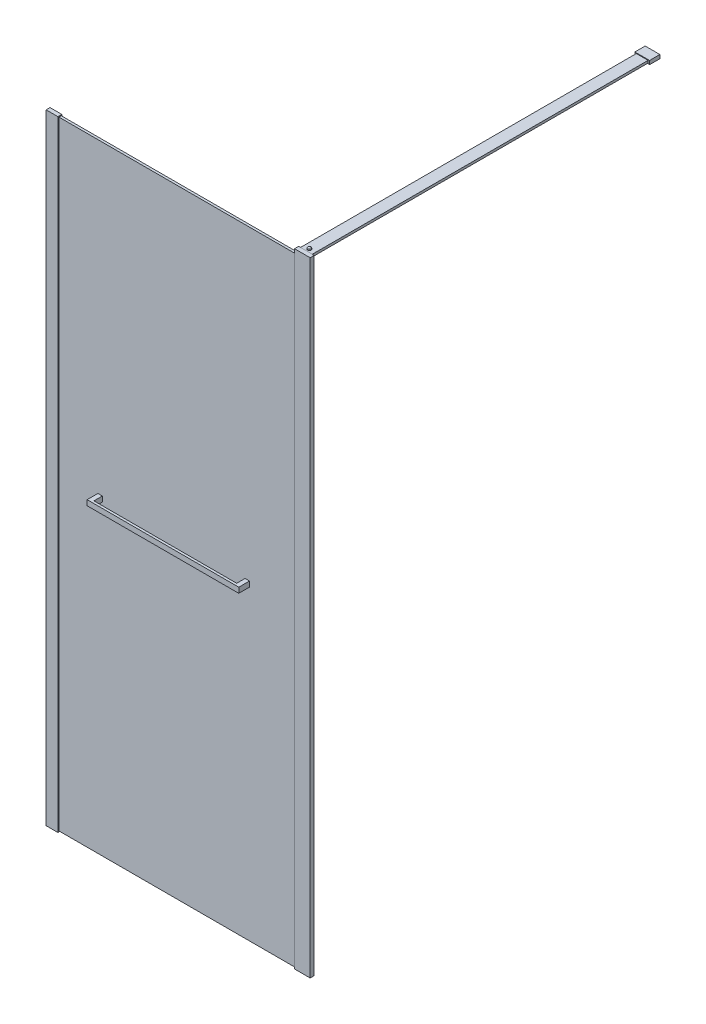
ISO-10303-21;
HEADER;
FILE_DESCRIPTION(('STEP AP214'),'2;1');
FILE_NAME('part.step','',(''),(''),'','','');
FILE_SCHEMA(('AUTOMOTIVE_DESIGN { 1 0 10303 214 1 1 1 1 }'));
ENDSEC;
DATA;
#1=APPLICATION_CONTEXT('core data for automotive mechanical design processes');
#2=APPLICATION_PROTOCOL_DEFINITION('international standard','automotive_design',2000,#1);
#3=PRODUCT_CONTEXT('',#1,'mechanical');
#4=PRODUCT('Part','Part','',(#3));
#5=PRODUCT_RELATED_PRODUCT_CATEGORY('part','',(#4));
#6=PRODUCT_DEFINITION_FORMATION('','',#4);
#7=PRODUCT_DEFINITION_CONTEXT('part definition',#1,'design');
#8=PRODUCT_DEFINITION('design','',#6,#7);
#9=PRODUCT_DEFINITION_SHAPE('','',#8);
#10=(LENGTH_UNIT() NAMED_UNIT(*) SI_UNIT(.MILLI.,.METRE.));
#11=(NAMED_UNIT(*) PLANE_ANGLE_UNIT() SI_UNIT($,.RADIAN.));
#12=(NAMED_UNIT(*) SI_UNIT($,.STERADIAN.) SOLID_ANGLE_UNIT());
#13=UNCERTAINTY_MEASURE_WITH_UNIT(LENGTH_MEASURE(1.E-05),#10,'distance_accuracy_value','');
#14=(GEOMETRIC_REPRESENTATION_CONTEXT(3) GLOBAL_UNCERTAINTY_ASSIGNED_CONTEXT((#13)) GLOBAL_UNIT_ASSIGNED_CONTEXT((#10,
#11,#12)) REPRESENTATION_CONTEXT('',''));
#15=CARTESIAN_POINT('',(0.,0.,0.));
#16=DIRECTION('',(0.,0.,1.));
#17=DIRECTION('',(1.,0.,0.));
#18=AXIS2_PLACEMENT_3D('',#15,#16,#17);
#19=CARTESIAN_POINT('',(187.5,1062.,-21.4));
#20=DIRECTION('',(1.,0.,0.));
#21=DIRECTION('',(0.,0.,-1.));
#22=AXIS2_PLACEMENT_3D('',#19,#20,#21);
#23=PLANE('',#22);
#24=DIRECTION('',(0.,1.,0.));
#25=VECTOR('',#24,1.);
#26=CARTESIAN_POINT('',(187.5,1062.,25.1));
#27=LINE('',#26,#25);
#28=CARTESIAN_POINT('',(187.5,1044.,25.1));
#29=VERTEX_POINT('',#28);
#30=CARTESIAN_POINT('',(187.5,1062.,25.1));
#31=VERTEX_POINT('',#30);
#32=EDGE_CURVE('E63',#29,#31,#27,.T.);
#33=ORIENTED_EDGE('',*,*,#32,.F.);
#34=DIRECTION('',(0.,0.,1.));
#35=VECTOR('',#34,1.);
#36=CARTESIAN_POINT('',(187.5,1044.,-21.4));
#37=LINE('',#36,#35);
#38=CARTESIAN_POINT('',(187.5,1044.,-21.4));
#39=VERTEX_POINT('',#38);
#40=EDGE_CURVE('E12',#39,#29,#37,.T.);
#41=ORIENTED_EDGE('',*,*,#40,.F.);
#42=DIRECTION('',(0.,1.,0.));
#43=VECTOR('',#42,1.);
#44=CARTESIAN_POINT('',(187.5,1062.,-21.4));
#45=LINE('',#44,#43);
#46=CARTESIAN_POINT('',(187.5,1062.,-21.4));
#47=VERTEX_POINT('',#46);
#48=EDGE_CURVE('E193',#39,#47,#45,.T.);
#49=ORIENTED_EDGE('',*,*,#48,.T.);
#50=DIRECTION('',(0.,0.,1.));
#51=VECTOR('',#50,1.);
#52=CARTESIAN_POINT('',(187.5,1062.,-21.4));
#53=LINE('',#52,#51);
#54=EDGE_CURVE('E176',#47,#31,#53,.T.);
#55=ORIENTED_EDGE('',*,*,#54,.T.);
#56=EDGE_LOOP('',(#33,#41,#49,#55));
#57=FACE_BOUND('',#56,.T.);
#58=ADVANCED_FACE('F46',(#57),#23,.T.);
#59=CARTESIAN_POINT('',(172.5,1044.,-21.4));
#60=DIRECTION('',(0.,-1.,0.));
#61=DIRECTION('',(0.,0.,-1.));
#62=AXIS2_PLACEMENT_3D('',#59,#60,#61);
#63=PLANE('',#62);
#64=ORIENTED_EDGE('',*,*,#40,.T.);
#65=DIRECTION('',(-1.,0.,0.));
#66=VECTOR('',#65,1.);
#67=CARTESIAN_POINT('',(692.197715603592,1044.,25.1));
#68=LINE('',#67,#66);
#69=CARTESIAN_POINT('',(672.5,1044.,25.1));
#70=VERTEX_POINT('',#69);
#71=EDGE_CURVE('E166',#70,#29,#68,.T.);
#72=ORIENTED_EDGE('',*,*,#71,.F.);
#73=DIRECTION('',(0.,0.,1.));
#74=VECTOR('',#73,1.);
#75=CARTESIAN_POINT('',(672.5,1044.,-21.4));
#76=LINE('',#75,#74);
#77=CARTESIAN_POINT('',(672.5,1044.,-21.4));
#78=VERTEX_POINT('',#77);
#79=EDGE_CURVE('E149',#78,#70,#76,.T.);
#80=ORIENTED_EDGE('',*,*,#79,.F.);
#81=DIRECTION('',(1.,0.,0.));
#82=VECTOR('',#81,1.);
#83=CARTESIAN_POINT('',(672.5,1044.,-21.4));
#84=LINE('',#83,#82);
#85=CARTESIAN_POINT('',(687.5,1044.,-21.4));
#86=VERTEX_POINT('',#85);
#87=EDGE_CURVE('E131',#78,#86,#84,.T.);
#88=ORIENTED_EDGE('',*,*,#87,.T.);
#89=DIRECTION('',(0.,0.,1.));
#90=VECTOR('',#89,1.);
#91=CARTESIAN_POINT('',(687.5,1044.,-21.4));
#92=LINE('',#91,#90);
#93=CARTESIAN_POINT('',(687.5,1044.,33.1));
#94=VERTEX_POINT('',#93);
#95=EDGE_CURVE('E147',#86,#94,#92,.T.);
#96=ORIENTED_EDGE('',*,*,#95,.T.);
#97=DIRECTION('',(1.,0.,0.));
#98=VECTOR('',#97,1.);
#99=CARTESIAN_POINT('',(172.5,1044.,33.1));
#100=LINE('',#99,#98);
#101=CARTESIAN_POINT('',(172.5,1044.,33.1));
#102=VERTEX_POINT('',#101);
#103=EDGE_CURVE('E135',#102,#94,#100,.T.);
#104=ORIENTED_EDGE('',*,*,#103,.F.);
#105=DIRECTION('',(0.,0.,1.));
#106=VECTOR('',#105,1.);
#107=CARTESIAN_POINT('',(172.5,1044.,-21.4));
#108=LINE('',#107,#106);
#109=CARTESIAN_POINT('',(172.5,1044.,-21.4));
#110=VERTEX_POINT('',#109);
#111=EDGE_CURVE('E55',#110,#102,#108,.T.);
#112=ORIENTED_EDGE('',*,*,#111,.F.);
#113=DIRECTION('',(1.,0.,0.));
#114=VECTOR('',#113,1.);
#115=CARTESIAN_POINT('',(172.5,1044.,-21.4));
#116=LINE('',#115,#114);
#117=EDGE_CURVE('E181',#110,#39,#116,.T.);
#118=ORIENTED_EDGE('',*,*,#117,.T.);
#119=EDGE_LOOP('',(#64,#72,#80,#88,#96,#104,#112,#118));
#120=FACE_BOUND('',#119,.T.);
#121=ADVANCED_FACE('F197',(#120),#63,.T.);
#122=CARTESIAN_POINT('',(172.5,1062.,-21.4));
#123=DIRECTION('',(-1.,0.,0.));
#124=DIRECTION('',(0.,0.,1.));
#125=AXIS2_PLACEMENT_3D('',#122,#123,#124);
#126=PLANE('',#125);
#127=ORIENTED_EDGE('',*,*,#111,.T.);
#128=DIRECTION('',(0.,-1.,0.));
#129=VECTOR('',#128,1.);
#130=CARTESIAN_POINT('',(172.5,1062.,33.1));
#131=LINE('',#130,#129);
#132=CARTESIAN_POINT('',(172.5,1062.,33.1));
#133=VERTEX_POINT('',#132);
#134=EDGE_CURVE('E121',#133,#102,#131,.T.);
#135=ORIENTED_EDGE('',*,*,#134,.F.);
#136=DIRECTION('',(0.,0.,1.));
#137=VECTOR('',#136,1.);
#138=CARTESIAN_POINT('',(172.5,1062.,-21.4));
#139=LINE('',#138,#137);
#140=CARTESIAN_POINT('',(172.5,1062.,-21.4));
#141=VERTEX_POINT('',#140);
#142=EDGE_CURVE('E116',#141,#133,#139,.T.);
#143=ORIENTED_EDGE('',*,*,#142,.F.);
#144=DIRECTION('',(0.,-1.,0.));
#145=VECTOR('',#144,1.);
#146=CARTESIAN_POINT('',(172.5,1062.,-21.4));
#147=LINE('',#146,#145);
#148=EDGE_CURVE('E186',#141,#110,#147,.T.);
#149=ORIENTED_EDGE('',*,*,#148,.T.);
#150=EDGE_LOOP('',(#127,#135,#143,#149));
#151=FACE_BOUND('',#150,.T.);
#152=ADVANCED_FACE('F218',(#151),#126,.T.);
#153=CARTESIAN_POINT('',(172.5,1062.,-21.4));
#154=DIRECTION('',(0.,1.,0.));
#155=DIRECTION('',(0.,0.,1.));
#156=AXIS2_PLACEMENT_3D('',#153,#154,#155);
#157=PLANE('',#156);
#158=ORIENTED_EDGE('',*,*,#142,.T.);
#159=DIRECTION('',(-1.,0.,0.));
#160=VECTOR('',#159,1.);
#161=CARTESIAN_POINT('',(172.5,1062.,33.1));
#162=LINE('',#161,#160);
#163=CARTESIAN_POINT('',(687.5,1062.,33.1));
#164=VERTEX_POINT('',#163);
#165=EDGE_CURVE('E109',#164,#133,#162,.T.);
#166=ORIENTED_EDGE('',*,*,#165,.F.);
#167=DIRECTION('',(0.,0.,1.));
#168=VECTOR('',#167,1.);
#169=CARTESIAN_POINT('',(687.5,1062.,-21.4));
#170=LINE('',#169,#168);
#171=CARTESIAN_POINT('',(687.5,1062.,-21.4));
#172=VERTEX_POINT('',#171);
#173=EDGE_CURVE('E113',#172,#164,#170,.T.);
#174=ORIENTED_EDGE('',*,*,#173,.F.);
#175=DIRECTION('',(-1.,0.,0.));
#176=VECTOR('',#175,1.);
#177=CARTESIAN_POINT('',(672.5,1062.,-21.4));
#178=LINE('',#177,#176);
#179=CARTESIAN_POINT('',(672.5,1062.,-21.4));
#180=VERTEX_POINT('',#179);
#181=EDGE_CURVE('E138',#172,#180,#178,.T.);
#182=ORIENTED_EDGE('',*,*,#181,.T.);
#183=DIRECTION('',(0.,0.,1.));
#184=VECTOR('',#183,1.);
#185=CARTESIAN_POINT('',(672.5,1062.,-21.4));
#186=LINE('',#185,#184);
#187=CARTESIAN_POINT('',(672.5,1062.,25.1));
#188=VERTEX_POINT('',#187);
#189=EDGE_CURVE('E130',#180,#188,#186,.T.);
#190=ORIENTED_EDGE('',*,*,#189,.T.);
#191=DIRECTION('',(-1.,0.,0.));
#192=VECTOR('',#191,1.);
#193=CARTESIAN_POINT('',(692.197715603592,1062.,25.1));
#194=LINE('',#193,#192);
#195=EDGE_CURVE('E163',#188,#31,#194,.T.);
#196=ORIENTED_EDGE('',*,*,#195,.T.);
#197=ORIENTED_EDGE('',*,*,#54,.F.);
#198=DIRECTION('',(-1.,0.,0.));
#199=VECTOR('',#198,1.);
#200=CARTESIAN_POINT('',(172.5,1062.,-21.4));
#201=LINE('',#200,#199);
#202=EDGE_CURVE('E190',#47,#141,#201,.T.);
#203=ORIENTED_EDGE('',*,*,#202,.T.);
#204=EDGE_LOOP('',(#158,#166,#174,#182,#190,#196,#197,#203));
#205=FACE_BOUND('',#204,.T.);
#206=ADVANCED_FACE('F111',(#205),#157,.T.);
#207=CARTESIAN_POINT('',(187.5,1044.,-21.4));
#208=DIRECTION('',(0.,0.,1.));
#209=DIRECTION('',(1.,0.,0.));
#210=AXIS2_PLACEMENT_3D('',#207,#208,#209);
#211=PLANE('',#210);
#212=ORIENTED_EDGE('',*,*,#48,.F.);
#213=ORIENTED_EDGE('',*,*,#117,.F.);
#214=ORIENTED_EDGE('',*,*,#148,.F.);
#215=ORIENTED_EDGE('',*,*,#202,.F.);
#216=EDGE_LOOP('',(#212,#213,#214,#215));
#217=FACE_BOUND('',#216,.T.);
#218=ADVANCED_FACE('F225',(#217),#211,.F.);
#219=CARTESIAN_POINT('',(187.5,1044.,33.1));
#220=DIRECTION('',(0.,0.,1.));
#221=DIRECTION('',(1.,0.,0.));
#222=AXIS2_PLACEMENT_3D('',#219,#220,#221);
#223=PLANE('',#222);
#224=ORIENTED_EDGE('',*,*,#103,.T.);
#225=DIRECTION('',(0.,1.,0.));
#226=VECTOR('',#225,1.);
#227=CARTESIAN_POINT('',(687.5,1062.,33.1));
#228=LINE('',#227,#226);
#229=EDGE_CURVE('E127',#94,#164,#228,.T.);
#230=ORIENTED_EDGE('',*,*,#229,.T.);
#231=ORIENTED_EDGE('',*,*,#165,.T.);
#232=ORIENTED_EDGE('',*,*,#134,.T.);
#233=EDGE_LOOP('',(#224,#230,#231,#232));
#234=FACE_BOUND('',#233,.T.);
#235=ADVANCED_FACE('F133',(#234),#223,.T.);
#236=CARTESIAN_POINT('',(692.197715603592,1062.,25.1));
#237=DIRECTION('',(0.,0.,1.));
#238=DIRECTION('',(1.,0.,0.));
#239=AXIS2_PLACEMENT_3D('',#236,#237,#238);
#240=PLANE('',#239);
#241=ORIENTED_EDGE('',*,*,#195,.F.);
#242=DIRECTION('',(0.,-1.,0.));
#243=VECTOR('',#242,1.);
#244=CARTESIAN_POINT('',(672.5,1062.,25.1));
#245=LINE('',#244,#243);
#246=EDGE_CURVE('E49',#188,#70,#245,.T.);
#247=ORIENTED_EDGE('',*,*,#246,.T.);
#248=ORIENTED_EDGE('',*,*,#71,.T.);
#249=ORIENTED_EDGE('',*,*,#32,.T.);
#250=EDGE_LOOP('',(#241,#247,#248,#249));
#251=FACE_BOUND('',#250,.T.);
#252=ADVANCED_FACE('F203',(#251),#240,.F.);
#253=CARTESIAN_POINT('',(672.5,1062.,-21.4));
#254=DIRECTION('',(-1.,0.,0.));
#255=DIRECTION('',(0.,0.,1.));
#256=AXIS2_PLACEMENT_3D('',#253,#254,#255);
#257=PLANE('',#256);
#258=ORIENTED_EDGE('',*,*,#246,.F.);
#259=ORIENTED_EDGE('',*,*,#189,.F.);
#260=DIRECTION('',(0.,-1.,0.));
#261=VECTOR('',#260,1.);
#262=CARTESIAN_POINT('',(672.5,1062.,-21.4));
#263=LINE('',#262,#261);
#264=EDGE_CURVE('E142',#180,#78,#263,.T.);
#265=ORIENTED_EDGE('',*,*,#264,.T.);
#266=ORIENTED_EDGE('',*,*,#79,.T.);
#267=EDGE_LOOP('',(#258,#259,#265,#266));
#268=FACE_BOUND('',#267,.T.);
#269=ADVANCED_FACE('F204',(#268),#257,.T.);
#270=CARTESIAN_POINT('',(687.5,1062.,-21.4));
#271=DIRECTION('',(1.,0.,0.));
#272=DIRECTION('',(0.,0.,-1.));
#273=AXIS2_PLACEMENT_3D('',#270,#271,#272);
#274=PLANE('',#273);
#275=ORIENTED_EDGE('',*,*,#173,.T.);
#276=ORIENTED_EDGE('',*,*,#229,.F.);
#277=ORIENTED_EDGE('',*,*,#95,.F.);
#278=DIRECTION('',(0.,1.,0.));
#279=VECTOR('',#278,1.);
#280=CARTESIAN_POINT('',(687.5,1062.,-21.4));
#281=LINE('',#280,#279);
#282=EDGE_CURVE('E129',#86,#172,#281,.T.);
#283=ORIENTED_EDGE('',*,*,#282,.T.);
#284=EDGE_LOOP('',(#275,#276,#277,#283));
#285=FACE_BOUND('',#284,.T.);
#286=ADVANCED_FACE('F126',(#285),#274,.T.);
#287=CARTESIAN_POINT('',(687.5,1044.,-21.4));
#288=DIRECTION('',(0.,0.,1.));
#289=DIRECTION('',(1.,0.,0.));
#290=AXIS2_PLACEMENT_3D('',#287,#288,#289);
#291=PLANE('',#290);
#292=ORIENTED_EDGE('',*,*,#282,.F.);
#293=ORIENTED_EDGE('',*,*,#87,.F.);
#294=ORIENTED_EDGE('',*,*,#264,.F.);
#295=ORIENTED_EDGE('',*,*,#181,.F.);
#296=EDGE_LOOP('',(#292,#293,#294,#295));
#297=FACE_BOUND('',#296,.T.);
#298=ADVANCED_FACE('F200',(#297),#291,.F.);
#299=CLOSED_SHELL('',(#58,#121,#152,#206,#218,#235,#252,#269,#286,#298));
#300=MANIFOLD_SOLID_BREP('B2',#299);
#301=CARTESIAN_POINT('',(889.9,2119.,-1184.4));
#302=DIRECTION('',(-1.,0.,0.));
#303=DIRECTION('',(0.,0.,1.));
#304=AXIS2_PLACEMENT_3D('',#301,#302,#303);
#305=PLANE('',#304);
#306=DIRECTION('',(0.,-1.,0.));
#307=VECTOR('',#306,1.);
#308=CARTESIAN_POINT('',(889.9,2119.,-1155.));
#309=LINE('',#308,#307);
#310=CARTESIAN_POINT('',(889.9,2119.,-1155.));
#311=VERTEX_POINT('',#310);
#312=CARTESIAN_POINT('',(889.9,2111.,-1155.));
#313=VERTEX_POINT('',#312);
#314=EDGE_CURVE('E417',#311,#313,#309,.T.);
#315=ORIENTED_EDGE('',*,*,#314,.F.);
#316=DIRECTION('',(0.,0.,1.));
#317=VECTOR('',#316,1.);
#318=CARTESIAN_POINT('',(889.9,2119.,-1184.4));
#319=LINE('',#318,#317);
#320=CARTESIAN_POINT('',(889.9,2119.,-14.4));
#321=VERTEX_POINT('',#320);
#322=EDGE_CURVE('E432',#311,#321,#319,.T.);
#323=ORIENTED_EDGE('',*,*,#322,.T.);
#324=DIRECTION('',(0.,-1.,0.));
#325=VECTOR('',#324,1.);
#326=CARTESIAN_POINT('',(889.9,2119.,-14.4));
#327=LINE('',#326,#325);
#328=CARTESIAN_POINT('',(889.9,2111.,-14.4));
#329=VERTEX_POINT('',#328);
#330=EDGE_CURVE('E420',#321,#329,#327,.T.);
#331=ORIENTED_EDGE('',*,*,#330,.T.);
#332=DIRECTION('',(0.,0.,1.));
#333=VECTOR('',#332,1.);
#334=CARTESIAN_POINT('',(889.9,2111.,-1184.4));
#335=LINE('',#334,#333);
#336=EDGE_CURVE('E327',#313,#329,#335,.T.);
#337=ORIENTED_EDGE('',*,*,#336,.F.);
#338=EDGE_LOOP('',(#315,#323,#331,#337));
#339=FACE_BOUND('',#338,.T.);
#340=ADVANCED_FACE('F319',(#339),#305,.F.);
#341=CARTESIAN_POINT('',(889.9,2111.,-1184.4));
#342=DIRECTION('',(0.,1.,0.));
#343=DIRECTION('',(0.,0.,1.));
#344=AXIS2_PLACEMENT_3D('',#341,#342,#343);
#345=PLANE('',#344);
#346=DIRECTION('',(-1.,0.,0.));
#347=VECTOR('',#346,1.);
#348=CARTESIAN_POINT('',(889.9,2111.,-1155.));
#349=LINE('',#348,#347);
#350=CARTESIAN_POINT('',(849.9,2111.,-1155.));
#351=VERTEX_POINT('',#350);
#352=EDGE_CURVE('E334',#313,#351,#349,.T.);
#353=ORIENTED_EDGE('',*,*,#352,.F.);
#354=ORIENTED_EDGE('',*,*,#336,.T.);
#355=DIRECTION('',(-1.,0.,0.));
#356=VECTOR('',#355,1.);
#357=CARTESIAN_POINT('',(889.9,2111.,-14.4));
#358=LINE('',#357,#356);
#359=CARTESIAN_POINT('',(849.9,2111.,-14.4));
#360=VERTEX_POINT('',#359);
#361=EDGE_CURVE('E423',#329,#360,#358,.T.);
#362=ORIENTED_EDGE('',*,*,#361,.T.);
#363=DIRECTION('',(0.,0.,1.));
#364=VECTOR('',#363,1.);
#365=CARTESIAN_POINT('',(849.9,2111.,-1184.4));
#366=LINE('',#365,#364);
#367=EDGE_CURVE('E436',#351,#360,#366,.T.);
#368=ORIENTED_EDGE('',*,*,#367,.F.);
#369=EDGE_LOOP('',(#353,#354,#362,#368));
#370=FACE_BOUND('',#369,.T.);
#371=ADVANCED_FACE('F438',(#370),#345,.F.);
#372=CARTESIAN_POINT('',(849.9,2119.,-1184.4));
#373=DIRECTION('',(1.,0.,0.));
#374=DIRECTION('',(0.,0.,-1.));
#375=AXIS2_PLACEMENT_3D('',#372,#373,#374);
#376=PLANE('',#375);
#377=DIRECTION('',(0.,1.,0.));
#378=VECTOR('',#377,1.);
#379=CARTESIAN_POINT('',(849.9,2119.,-1155.));
#380=LINE('',#379,#378);
#381=CARTESIAN_POINT('',(849.9,2119.,-1155.));
#382=VERTEX_POINT('',#381);
#383=EDGE_CURVE('E342',#351,#382,#380,.T.);
#384=ORIENTED_EDGE('',*,*,#383,.F.);
#385=ORIENTED_EDGE('',*,*,#367,.T.);
#386=DIRECTION('',(0.,1.,0.));
#387=VECTOR('',#386,1.);
#388=CARTESIAN_POINT('',(849.9,2119.,-14.4));
#389=LINE('',#388,#387);
#390=CARTESIAN_POINT('',(849.9,2119.,-14.4));
#391=VERTEX_POINT('',#390);
#392=EDGE_CURVE('E426',#360,#391,#389,.T.);
#393=ORIENTED_EDGE('',*,*,#392,.T.);
#394=DIRECTION('',(0.,0.,1.));
#395=VECTOR('',#394,1.);
#396=CARTESIAN_POINT('',(849.9,2119.,-1184.4));
#397=LINE('',#396,#395);
#398=EDGE_CURVE('E434',#382,#391,#397,.T.);
#399=ORIENTED_EDGE('',*,*,#398,.F.);
#400=EDGE_LOOP('',(#384,#385,#393,#399));
#401=FACE_BOUND('',#400,.T.);
#402=ADVANCED_FACE('F448',(#401),#376,.F.);
#403=CARTESIAN_POINT('',(889.9,2119.,-1184.4));
#404=DIRECTION('',(0.,-1.,0.));
#405=DIRECTION('',(0.,0.,-1.));
#406=AXIS2_PLACEMENT_3D('',#403,#404,#405);
#407=PLANE('',#406);
#408=CARTESIAN_POINT('',(869.9,2119.,-24.3999999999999));
#409=DIRECTION('',(0.,-1.,0.));
#410=DIRECTION('',(0.,0.,-1.));
#411=AXIS2_PLACEMENT_3D('',#408,#409,#410);
#412=CIRCLE('',#411,5.90000000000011);
#413=CARTESIAN_POINT('',(869.9,2119.,-30.3));
#414=VERTEX_POINT('',#413);
#415=EDGE_CURVE('E511',#414,#414,#412,.T.);
#416=ORIENTED_EDGE('',*,*,#415,.T.);
#417=EDGE_LOOP('',(#416));
#418=FACE_BOUND('',#417,.T.);
#419=DIRECTION('',(1.,0.,0.));
#420=VECTOR('',#419,1.);
#421=CARTESIAN_POINT('',(889.9,2119.,-1155.));
#422=LINE('',#421,#420);
#423=EDGE_CURVE('E44',#382,#311,#422,.T.);
#424=ORIENTED_EDGE('',*,*,#423,.F.);
#425=ORIENTED_EDGE('',*,*,#398,.T.);
#426=DIRECTION('',(1.,0.,0.));
#427=VECTOR('',#426,1.);
#428=CARTESIAN_POINT('',(889.9,2119.,-14.4));
#429=LINE('',#428,#427);
#430=EDGE_CURVE('E429',#391,#321,#429,.T.);
#431=ORIENTED_EDGE('',*,*,#430,.T.);
#432=ORIENTED_EDGE('',*,*,#322,.F.);
#433=EDGE_LOOP('',(#424,#425,#431,#432));
#434=FACE_BOUND('',#433,.T.);
#435=ADVANCED_FACE('F447',(#418,#434),#407,.F.);
#436=CARTESIAN_POINT('',(889.9,2111.,-14.4));
#437=DIRECTION('',(0.,0.,-1.));
#438=DIRECTION('',(-1.,0.,0.));
#439=AXIS2_PLACEMENT_3D('',#436,#437,#438);
#440=PLANE('',#439);
#441=ORIENTED_EDGE('',*,*,#330,.F.);
#442=ORIENTED_EDGE('',*,*,#430,.F.);
#443=ORIENTED_EDGE('',*,*,#392,.F.);
#444=ORIENTED_EDGE('',*,*,#361,.F.);
#445=EDGE_LOOP('',(#441,#442,#443,#444));
#446=FACE_BOUND('',#445,.T.);
#447=ADVANCED_FACE('F444',(#446),#440,.F.);
#448=CARTESIAN_POINT('',(844.9,2108.75,-1155.));
#449=DIRECTION('',(0.,0.,-1.));
#450=DIRECTION('',(-1.,0.,0.));
#451=AXIS2_PLACEMENT_3D('',#448,#449,#450);
#452=PLANE('',#451);
#453=DIRECTION('',(0.,1.,0.));
#454=VECTOR('',#453,1.);
#455=CARTESIAN_POINT('',(844.9,2121.25,-1155.));
#456=LINE('',#455,#454);
#457=CARTESIAN_POINT('',(844.9,2108.75,-1155.));
#458=VERTEX_POINT('',#457);
#459=CARTESIAN_POINT('',(844.9,2121.25,-1155.));
#460=VERTEX_POINT('',#459);
#461=EDGE_CURVE('E409',#458,#460,#456,.T.);
#462=ORIENTED_EDGE('',*,*,#461,.F.);
#463=DIRECTION('',(-1.,0.,0.));
#464=VECTOR('',#463,1.);
#465=CARTESIAN_POINT('',(894.9,2108.75,-1155.));
#466=LINE('',#465,#464);
#467=CARTESIAN_POINT('',(894.9,2108.75,-1155.));
#468=VERTEX_POINT('',#467);
#469=EDGE_CURVE('E405',#468,#458,#466,.T.);
#470=ORIENTED_EDGE('',*,*,#469,.F.);
#471=DIRECTION('',(0.,-1.,0.));
#472=VECTOR('',#471,1.);
#473=CARTESIAN_POINT('',(894.9,2121.25,-1155.));
#474=LINE('',#473,#472);
#475=CARTESIAN_POINT('',(894.9,2121.25,-1155.));
#476=VERTEX_POINT('',#475);
#477=EDGE_CURVE('E492',#476,#468,#474,.T.);
#478=ORIENTED_EDGE('',*,*,#477,.F.);
#479=DIRECTION('',(1.,0.,0.));
#480=VECTOR('',#479,1.);
#481=CARTESIAN_POINT('',(894.9,2121.25,-1155.));
#482=LINE('',#481,#480);
#483=EDGE_CURVE('E495',#460,#476,#482,.T.);
#484=ORIENTED_EDGE('',*,*,#483,.F.);
#485=EDGE_LOOP('',(#462,#470,#478,#484));
#486=FACE_BOUND('',#485,.T.);
#487=ORIENTED_EDGE('',*,*,#423,.T.);
#488=ORIENTED_EDGE('',*,*,#314,.T.);
#489=ORIENTED_EDGE('',*,*,#352,.T.);
#490=ORIENTED_EDGE('',*,*,#383,.T.);
#491=EDGE_LOOP('',(#487,#488,#489,#490));
#492=FACE_BOUND('',#491,.T.);
#493=ADVANCED_FACE('F450',(#486,#492),#452,.F.);
#494=CARTESIAN_POINT('',(844.9,2121.25,-1190.));
#495=DIRECTION('',(1.,0.,0.));
#496=DIRECTION('',(0.,0.,-1.));
#497=AXIS2_PLACEMENT_3D('',#494,#495,#496);
#498=PLANE('',#497);
#499=ORIENTED_EDGE('',*,*,#461,.T.);
#500=DIRECTION('',(0.,0.,1.));
#501=VECTOR('',#500,1.);
#502=CARTESIAN_POINT('',(844.9,2121.25,-1190.));
#503=LINE('',#502,#501);
#504=CARTESIAN_POINT('',(844.9,2121.25,-1190.));
#505=VERTEX_POINT('',#504);
#506=EDGE_CURVE('E389',#505,#460,#503,.T.);
#507=ORIENTED_EDGE('',*,*,#506,.F.);
#508=DIRECTION('',(0.,1.,0.));
#509=VECTOR('',#508,1.);
#510=CARTESIAN_POINT('',(844.9,2121.25,-1190.));
#511=LINE('',#510,#509);
#512=CARTESIAN_POINT('',(844.9,2108.75,-1190.));
#513=VERTEX_POINT('',#512);
#514=EDGE_CURVE('E396',#513,#505,#511,.T.);
#515=ORIENTED_EDGE('',*,*,#514,.F.);
#516=DIRECTION('',(0.,0.,1.));
#517=VECTOR('',#516,1.);
#518=CARTESIAN_POINT('',(844.9,2108.75,-1190.));
#519=LINE('',#518,#517);
#520=EDGE_CURVE('E489',#513,#458,#519,.T.);
#521=ORIENTED_EDGE('',*,*,#520,.T.);
#522=EDGE_LOOP('',(#499,#507,#515,#521));
#523=FACE_BOUND('',#522,.T.);
#524=ADVANCED_FACE('F407',(#523),#498,.F.);
#525=CARTESIAN_POINT('',(894.9,2121.25,-1190.));
#526=DIRECTION('',(0.,-1.,0.));
#527=DIRECTION('',(0.,0.,-1.));
#528=AXIS2_PLACEMENT_3D('',#525,#526,#527);
#529=PLANE('',#528);
#530=ORIENTED_EDGE('',*,*,#483,.T.);
#531=DIRECTION('',(0.,0.,1.));
#532=VECTOR('',#531,1.);
#533=CARTESIAN_POINT('',(894.9,2121.25,-1190.));
#534=LINE('',#533,#532);
#535=CARTESIAN_POINT('',(894.9,2121.25,-1190.));
#536=VERTEX_POINT('',#535);
#537=EDGE_CURVE('E392',#536,#476,#534,.T.);
#538=ORIENTED_EDGE('',*,*,#537,.F.);
#539=DIRECTION('',(1.,0.,0.));
#540=VECTOR('',#539,1.);
#541=CARTESIAN_POINT('',(894.9,2121.25,-1190.));
#542=LINE('',#541,#540);
#543=EDGE_CURVE('E385',#505,#536,#542,.T.);
#544=ORIENTED_EDGE('',*,*,#543,.F.);
#545=ORIENTED_EDGE('',*,*,#506,.T.);
#546=EDGE_LOOP('',(#530,#538,#544,#545));
#547=FACE_BOUND('',#546,.T.);
#548=ADVANCED_FACE('F387',(#547),#529,.F.);
#549=CARTESIAN_POINT('',(894.9,2121.25,-1190.));
#550=DIRECTION('',(-1.,0.,0.));
#551=DIRECTION('',(0.,0.,1.));
#552=AXIS2_PLACEMENT_3D('',#549,#550,#551);
#553=PLANE('',#552);
#554=ORIENTED_EDGE('',*,*,#477,.T.);
#555=DIRECTION('',(0.,0.,1.));
#556=VECTOR('',#555,1.);
#557=CARTESIAN_POINT('',(894.9,2108.75,-1190.));
#558=LINE('',#557,#556);
#559=CARTESIAN_POINT('',(894.9,2108.75,-1190.));
#560=VERTEX_POINT('',#559);
#561=EDGE_CURVE('E412',#560,#468,#558,.T.);
#562=ORIENTED_EDGE('',*,*,#561,.F.);
#563=DIRECTION('',(0.,-1.,0.));
#564=VECTOR('',#563,1.);
#565=CARTESIAN_POINT('',(894.9,2121.25,-1190.));
#566=LINE('',#565,#564);
#567=EDGE_CURVE('E395',#536,#560,#566,.T.);
#568=ORIENTED_EDGE('',*,*,#567,.F.);
#569=ORIENTED_EDGE('',*,*,#537,.T.);
#570=EDGE_LOOP('',(#554,#562,#568,#569));
#571=FACE_BOUND('',#570,.T.);
#572=ADVANCED_FACE('F477',(#571),#553,.F.);
#573=CARTESIAN_POINT('',(894.9,2108.75,-1190.));
#574=DIRECTION('',(0.,1.,0.));
#575=DIRECTION('',(0.,0.,1.));
#576=AXIS2_PLACEMENT_3D('',#573,#574,#575);
#577=PLANE('',#576);
#578=ORIENTED_EDGE('',*,*,#469,.T.);
#579=ORIENTED_EDGE('',*,*,#520,.F.);
#580=DIRECTION('',(-1.,0.,0.));
#581=VECTOR('',#580,1.);
#582=CARTESIAN_POINT('',(894.9,2108.75,-1190.));
#583=LINE('',#582,#581);
#584=EDGE_CURVE('E401',#560,#513,#583,.T.);
#585=ORIENTED_EDGE('',*,*,#584,.F.);
#586=ORIENTED_EDGE('',*,*,#561,.T.);
#587=EDGE_LOOP('',(#578,#579,#585,#586));
#588=FACE_BOUND('',#587,.T.);
#589=ADVANCED_FACE('F479',(#588),#577,.F.);
#590=CARTESIAN_POINT('',(844.9,2108.75,-1190.));
#591=DIRECTION('',(0.,0.,-1.));
#592=DIRECTION('',(-1.,0.,0.));
#593=AXIS2_PLACEMENT_3D('',#590,#591,#592);
#594=PLANE('',#593);
#595=ORIENTED_EDGE('',*,*,#514,.T.);
#596=ORIENTED_EDGE('',*,*,#543,.T.);
#597=ORIENTED_EDGE('',*,*,#567,.T.);
#598=ORIENTED_EDGE('',*,*,#584,.T.);
#599=EDGE_LOOP('',(#595,#596,#597,#598));
#600=FACE_BOUND('',#599,.T.);
#601=ADVANCED_FACE('F399',(#600),#594,.T.);
#602=CARTESIAN_POINT('',(869.9,2115.34934210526,-24.4));
#603=DIRECTION('',(0.,-1.,0.));
#604=DIRECTION('',(0.,0.,-1.));
#605=AXIS2_PLACEMENT_3D('',#602,#603,#604);
#606=SPHERICAL_SURFACE('',#605,9.35065789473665);
#607=CARTESIAN_POINT('',(869.9,2122.8,-24.3999999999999));
#608=DIRECTION('',(0.,-1.,0.));
#609=DIRECTION('',(0.,0.,-1.));
#610=AXIS2_PLACEMENT_3D('',#607,#608,#609);
#611=CIRCLE('',#610,5.65000000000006);
#612=CARTESIAN_POINT('',(869.9,2122.8,-30.05));
#613=VERTEX_POINT('',#612);
#614=EDGE_CURVE('E508',#613,#613,#611,.T.);
#615=ORIENTED_EDGE('',*,*,#614,.F.);
#616=EDGE_LOOP('',(#615));
#617=FACE_BOUND('',#616,.T.);
#618=ADVANCED_FACE('F486',(#617),#606,.T.);
#619=CARTESIAN_POINT('',(869.9,2119.,-24.3999999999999));
#620=DIRECTION('',(0.,-1.,0.));
#621=DIRECTION('',(0.,0.,-1.));
#622=AXIS2_PLACEMENT_3D('',#619,#620,#621);
#623=CONICAL_SURFACE('',#622,5.90000000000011,0.0656948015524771);
#624=ORIENTED_EDGE('',*,*,#614,.T.);
#625=EDGE_LOOP('',(#624));
#626=FACE_BOUND('',#625,.T.);
#627=ORIENTED_EDGE('',*,*,#415,.F.);
#628=EDGE_LOOP('',(#627));
#629=FACE_BOUND('',#628,.T.);
#630=ADVANCED_FACE('F515',(#626,#629),#623,.T.);
#631=CLOSED_SHELL('',(#340,#371,#402,#435,#447,#493,#524,#548,#572,#589,#601,#618,#630));
#632=CARTESIAN_POINT('',(869.9,2122.53567623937,-24.3999999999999));
#633=DIRECTION('',(0.,-1.,0.));
#634=DIRECTION('',(0.,0.,-1.));
#635=AXIS2_PLACEMENT_3D('',#632,#633,#634);
#636=CONICAL_SURFACE('',#635,5.1663088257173,0.0656948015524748);
#637=CARTESIAN_POINT('',(869.9,2119.,-24.3999999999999));
#638=DIRECTION('',(0.,-1.,0.));
#639=DIRECTION('',(0.,0.,-1.));
#640=AXIS2_PLACEMENT_3D('',#637,#638,#639);
#641=CIRCLE('',#640,5.398919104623);
#642=CARTESIAN_POINT('',(869.9,2119.,-29.7989191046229));
#643=VERTEX_POINT('',#642);
#644=EDGE_CURVE('E496',#643,#643,#641,.T.);
#645=ORIENTED_EDGE('',*,*,#644,.T.);
#646=EDGE_LOOP('',(#645));
#647=FACE_BOUND('',#646,.T.);
#648=CARTESIAN_POINT('',(869.9,2122.53567623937,-24.3999999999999));
#649=DIRECTION('',(0.,-1.,0.));
#650=DIRECTION('',(0.,0.,-1.));
#651=AXIS2_PLACEMENT_3D('',#648,#649,#650);
#652=CIRCLE('',#651,5.1663088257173);
#653=CARTESIAN_POINT('',(869.9,2122.53567623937,-29.5663088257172));
#654=VERTEX_POINT('',#653);
#655=EDGE_CURVE('E500',#654,#654,#652,.T.);
#656=ORIENTED_EDGE('',*,*,#655,.F.);
#657=EDGE_LOOP('',(#656));
#658=FACE_BOUND('',#657,.T.);
#659=ADVANCED_FACE('F529',(#647,#658),#636,.F.);
#660=CARTESIAN_POINT('',(869.9,2115.34934210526,-24.4));
#661=DIRECTION('',(0.,-1.,0.));
#662=DIRECTION('',(0.,0.,1.));
#663=AXIS2_PLACEMENT_3D('',#660,#661,#662);
#664=SPHERICAL_SURFACE('',#663,8.85065789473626);
#665=ORIENTED_EDGE('',*,*,#655,.T.);
#666=EDGE_LOOP('',(#665));
#667=FACE_BOUND('',#666,.T.);
#668=ADVANCED_FACE('F526',(#667),#664,.F.);
#669=ORIENTED_EDGE('',*,*,#644,.F.);
#670=EDGE_LOOP('',(#669));
#671=FACE_BOUND('',#670,.T.);
#672=ADVANCED_FACE('F473',(#671),#407,.F.);
#673=CLOSED_SHELL('',(#659,#668,#672));
#674=ORIENTED_CLOSED_SHELL('',*,#673,.T.);
#675=BREP_WITH_VOIDS('B6',#631,(#674));
#676=CARTESIAN_POINT('',(896.4,2111.,-0.399999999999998));
#677=DIRECTION('',(0.,-1.,0.));
#678=DIRECTION('',(0.,0.,-1.));
#679=AXIS2_PLACEMENT_3D('',#676,#677,#678);
#680=PLANE('',#679);
#681=DIRECTION('',(-1.,0.,0.));
#682=VECTOR('',#681,1.);
#683=CARTESIAN_POINT('',(843.4,2111.,-11.4));
#684=LINE('',#683,#682);
#685=CARTESIAN_POINT('',(844.7,2111.,-11.4));
#686=VERTEX_POINT('',#685);
#687=CARTESIAN_POINT('',(843.4,2111.,-11.4));
#688=VERTEX_POINT('',#687);
#689=EDGE_CURVE('E781',#686,#688,#684,.T.);
#690=ORIENTED_EDGE('',*,*,#689,.F.);
#691=DIRECTION('',(0.,0.,1.));
#692=VECTOR('',#691,1.);
#693=CARTESIAN_POINT('',(844.7,2111.,-0.399999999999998));
#694=LINE('',#693,#692);
#695=CARTESIAN_POINT('',(844.7,2111.,-3.39999999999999));
#696=VERTEX_POINT('',#695);
#697=EDGE_CURVE('E647',#686,#696,#694,.T.);
#698=ORIENTED_EDGE('',*,*,#697,.T.);
#699=DIRECTION('',(1.,0.,0.));
#700=VECTOR('',#699,1.);
#701=CARTESIAN_POINT('',(853.5,2111.,-3.39999999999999));
#702=LINE('',#701,#700);
#703=CARTESIAN_POINT('',(843.4,2111.,-3.39999999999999));
#704=VERTEX_POINT('',#703);
#705=EDGE_CURVE('E785',#704,#696,#702,.T.);
#706=ORIENTED_EDGE('',*,*,#705,.F.);
#707=DIRECTION('',(0.,0.,1.));
#708=VECTOR('',#707,1.);
#709=CARTESIAN_POINT('',(843.4,2111.,-14.4));
#710=LINE('',#709,#708);
#711=EDGE_CURVE('E762',#688,#704,#710,.T.);
#712=ORIENTED_EDGE('',*,*,#711,.F.);
#713=EDGE_LOOP('',(#690,#698,#706,#712));
#714=FACE_BOUND('',#713,.T.);
#715=ADVANCED_FACE('F638',(#714),#680,.T.);
#716=CARTESIAN_POINT('',(853.5,2111.,-3.39999999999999));
#717=DIRECTION('',(0.,0.,-1.));
#718=DIRECTION('',(-1.,0.,0.));
#719=AXIS2_PLACEMENT_3D('',#716,#717,#718);
#720=PLANE('',#719);
#721=DIRECTION('',(-1.,0.,0.));
#722=VECTOR('',#721,1.);
#723=CARTESIAN_POINT('',(853.5,2103.2,-3.39999999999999));
#724=LINE('',#723,#722);
#725=CARTESIAN_POINT('',(853.5,2103.2,-3.39999999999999));
#726=VERTEX_POINT('',#725);
#727=CARTESIAN_POINT('',(844.7,2103.2,-3.39999999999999));
#728=VERTEX_POINT('',#727);
#729=EDGE_CURVE('E760',#726,#728,#724,.T.);
#730=ORIENTED_EDGE('',*,*,#729,.F.);
#731=DIRECTION('',(0.,-1.,0.));
#732=VECTOR('',#731,1.);
#733=CARTESIAN_POINT('',(853.5,2111.,-3.39999999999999));
#734=LINE('',#733,#732);
#735=CARTESIAN_POINT('',(853.5,3.,-3.39999999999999));
#736=VERTEX_POINT('',#735);
#737=EDGE_CURVE('E784',#726,#736,#734,.T.);
#738=ORIENTED_EDGE('',*,*,#737,.T.);
#739=DIRECTION('',(1.,0.,0.));
#740=VECTOR('',#739,1.);
#741=CARTESIAN_POINT('',(853.5,3.,-3.39999999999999));
#742=LINE('',#741,#740);
#743=CARTESIAN_POINT('',(843.4,3.,-3.39999999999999));
#744=VERTEX_POINT('',#743);
#745=EDGE_CURVE('E772',#744,#736,#742,.T.);
#746=ORIENTED_EDGE('',*,*,#745,.F.);
#747=DIRECTION('',(0.,-1.,0.));
#748=VECTOR('',#747,1.);
#749=CARTESIAN_POINT('',(843.4,2111.,-3.39999999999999));
#750=LINE('',#749,#748);
#751=EDGE_CURVE('E663',#704,#744,#750,.T.);
#752=ORIENTED_EDGE('',*,*,#751,.F.);
#753=ORIENTED_EDGE('',*,*,#705,.T.);
#754=DIRECTION('',(0.,-1.,0.));
#755=VECTOR('',#754,1.);
#756=CARTESIAN_POINT('',(844.7,2111.,-3.39999999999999));
#757=LINE('',#756,#755);
#758=EDGE_CURVE('E655',#696,#728,#757,.T.);
#759=ORIENTED_EDGE('',*,*,#758,.T.);
#760=EDGE_LOOP('',(#730,#738,#746,#752,#753,#759));
#761=FACE_BOUND('',#760,.T.);
#762=ADVANCED_FACE('F640',(#761),#720,.T.);
#763=CARTESIAN_POINT('',(843.4,2111.,-3.39999999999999));
#764=DIRECTION('',(-1.,0.,0.));
#765=DIRECTION('',(0.,0.,1.));
#766=AXIS2_PLACEMENT_3D('',#763,#764,#765);
#767=PLANE('',#766);
#768=DIRECTION('',(0.,-1.,0.));
#769=VECTOR('',#768,1.);
#770=CARTESIAN_POINT('',(843.4,2111.,-14.4));
#771=LINE('',#770,#769);
#772=CARTESIAN_POINT('',(843.4,2119.,-14.4));
#773=VERTEX_POINT('',#772);
#774=CARTESIAN_POINT('',(843.4,0.,-14.4));
#775=VERTEX_POINT('',#774);
#776=EDGE_CURVE('E719',#773,#775,#771,.T.);
#777=ORIENTED_EDGE('',*,*,#776,.T.);
#778=DIRECTION('',(0.,0.,-1.));
#779=VECTOR('',#778,1.);
#780=CARTESIAN_POINT('',(843.4,0.,-0.399999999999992));
#781=LINE('',#780,#779);
#782=CARTESIAN_POINT('',(843.4,0.,-0.399999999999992));
#783=VERTEX_POINT('',#782);
#784=EDGE_CURVE('E723',#783,#775,#781,.T.);
#785=ORIENTED_EDGE('',*,*,#784,.F.);
#786=DIRECTION('',(0.,-1.,0.));
#787=VECTOR('',#786,1.);
#788=CARTESIAN_POINT('',(843.4,2111.,-0.399999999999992));
#789=LINE('',#788,#787);
#790=CARTESIAN_POINT('',(843.4,2119.,-0.399999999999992));
#791=VERTEX_POINT('',#790);
#792=EDGE_CURVE('E793',#791,#783,#789,.T.);
#793=ORIENTED_EDGE('',*,*,#792,.F.);
#794=DIRECTION('',(0.,0.,1.));
#795=VECTOR('',#794,1.);
#796=CARTESIAN_POINT('',(843.4,2119.,-14.4));
#797=LINE('',#796,#795);
#798=EDGE_CURVE('E725',#773,#791,#797,.T.);
#799=ORIENTED_EDGE('',*,*,#798,.F.);
#800=EDGE_LOOP('',(#777,#785,#793,#799));
#801=FACE_BOUND('',#800,.T.);
#802=ORIENTED_EDGE('',*,*,#751,.T.);
#803=DIRECTION('',(0.,0.,-1.));
#804=VECTOR('',#803,1.);
#805=CARTESIAN_POINT('',(843.4,3.,-0.399999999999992));
#806=LINE('',#805,#804);
#807=CARTESIAN_POINT('',(843.4,3.,-11.4));
#808=VERTEX_POINT('',#807);
#809=EDGE_CURVE('E744',#744,#808,#806,.T.);
#810=ORIENTED_EDGE('',*,*,#809,.T.);
#811=DIRECTION('',(0.,-1.,0.));
#812=VECTOR('',#811,1.);
#813=CARTESIAN_POINT('',(843.4,2111.,-11.4));
#814=LINE('',#813,#812);
#815=EDGE_CURVE('E730',#688,#808,#814,.T.);
#816=ORIENTED_EDGE('',*,*,#815,.F.);
#817=ORIENTED_EDGE('',*,*,#711,.T.);
#818=EDGE_LOOP('',(#802,#810,#816,#817));
#819=FACE_BOUND('',#818,.T.);
#820=ADVANCED_FACE('F721',(#801,#819),#767,.T.);
#821=CARTESIAN_POINT('',(843.4,2111.,-0.399999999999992));
#822=DIRECTION('',(0.,0.,1.));
#823=DIRECTION('',(1.,0.,0.));
#824=AXIS2_PLACEMENT_3D('',#821,#822,#823);
#825=PLANE('',#824);
#826=ORIENTED_EDGE('',*,*,#792,.T.);
#827=DIRECTION('',(-1.,0.,0.));
#828=VECTOR('',#827,1.);
#829=CARTESIAN_POINT('',(843.4,0.,-0.399999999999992));
#830=LINE('',#829,#828);
#831=CARTESIAN_POINT('',(896.4,0.,-0.399999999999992));
#832=VERTEX_POINT('',#831);
#833=EDGE_CURVE('E743',#832,#783,#830,.T.);
#834=ORIENTED_EDGE('',*,*,#833,.F.);
#835=DIRECTION('',(0.,-1.,0.));
#836=VECTOR('',#835,1.);
#837=CARTESIAN_POINT('',(896.4,2111.,-0.399999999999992));
#838=LINE('',#837,#836);
#839=CARTESIAN_POINT('',(896.4,2119.,-0.399999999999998));
#840=VERTEX_POINT('',#839);
#841=EDGE_CURVE('E795',#840,#832,#838,.T.);
#842=ORIENTED_EDGE('',*,*,#841,.F.);
#843=DIRECTION('',(1.,0.,0.));
#844=VECTOR('',#843,1.);
#845=CARTESIAN_POINT('',(896.4,2119.,-0.399999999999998));
#846=LINE('',#845,#844);
#847=EDGE_CURVE('E769',#791,#840,#846,.T.);
#848=ORIENTED_EDGE('',*,*,#847,.F.);
#849=EDGE_LOOP('',(#826,#834,#842,#848));
#850=FACE_BOUND('',#849,.T.);
#851=ADVANCED_FACE('F822',(#850),#825,.T.);
#852=CARTESIAN_POINT('',(896.4,2111.,-0.399999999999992));
#853=DIRECTION('',(1.,0.,0.));
#854=DIRECTION('',(0.,0.,-1.));
#855=AXIS2_PLACEMENT_3D('',#852,#853,#854);
#856=PLANE('',#855);
#857=ORIENTED_EDGE('',*,*,#841,.T.);
#858=DIRECTION('',(0.,0.,1.));
#859=VECTOR('',#858,1.);
#860=CARTESIAN_POINT('',(896.4,0.,-0.399999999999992));
#861=LINE('',#860,#859);
#862=CARTESIAN_POINT('',(896.4,0.,-14.4));
#863=VERTEX_POINT('',#862);
#864=EDGE_CURVE('E738',#863,#832,#861,.T.);
#865=ORIENTED_EDGE('',*,*,#864,.F.);
#866=DIRECTION('',(0.,-1.,0.));
#867=VECTOR('',#866,1.);
#868=CARTESIAN_POINT('',(896.4,2111.,-14.4));
#869=LINE('',#868,#867);
#870=CARTESIAN_POINT('',(896.4,2119.,-14.4));
#871=VERTEX_POINT('',#870);
#872=EDGE_CURVE('E729',#871,#863,#869,.T.);
#873=ORIENTED_EDGE('',*,*,#872,.F.);
#874=DIRECTION('',(0.,0.,-1.));
#875=VECTOR('',#874,1.);
#876=CARTESIAN_POINT('',(896.4,2119.,-14.4));
#877=LINE('',#876,#875);
#878=EDGE_CURVE('E763',#840,#871,#877,.T.);
#879=ORIENTED_EDGE('',*,*,#878,.F.);
#880=EDGE_LOOP('',(#857,#865,#873,#879));
#881=FACE_BOUND('',#880,.T.);
#882=ADVANCED_FACE('F828',(#881),#856,.T.);
#883=CARTESIAN_POINT('',(896.4,2111.,-14.4));
#884=DIRECTION('',(0.,0.,-1.));
#885=DIRECTION('',(-1.,0.,0.));
#886=AXIS2_PLACEMENT_3D('',#883,#884,#885);
#887=PLANE('',#886);
#888=ORIENTED_EDGE('',*,*,#872,.T.);
#889=DIRECTION('',(1.,0.,0.));
#890=VECTOR('',#889,1.);
#891=CARTESIAN_POINT('',(843.4,0.,-14.4));
#892=LINE('',#891,#890);
#893=EDGE_CURVE('E733',#775,#863,#892,.T.);
#894=ORIENTED_EDGE('',*,*,#893,.F.);
#895=ORIENTED_EDGE('',*,*,#776,.F.);
#896=DIRECTION('',(-1.,0.,0.));
#897=VECTOR('',#896,1.);
#898=CARTESIAN_POINT('',(896.4,2119.,-14.4));
#899=LINE('',#898,#897);
#900=EDGE_CURVE('E766',#871,#773,#899,.T.);
#901=ORIENTED_EDGE('',*,*,#900,.F.);
#902=EDGE_LOOP('',(#888,#894,#895,#901));
#903=FACE_BOUND('',#902,.T.);
#904=ADVANCED_FACE('F734',(#903),#887,.T.);
#905=CARTESIAN_POINT('',(843.4,2111.,-11.4));
#906=DIRECTION('',(0.,0.,1.));
#907=DIRECTION('',(1.,0.,0.));
#908=AXIS2_PLACEMENT_3D('',#905,#906,#907);
#909=PLANE('',#908);
#910=DIRECTION('',(1.,0.,0.));
#911=VECTOR('',#910,1.);
#912=CARTESIAN_POINT('',(843.4,2103.2,-11.4));
#913=LINE('',#912,#911);
#914=CARTESIAN_POINT('',(844.7,2103.2,-11.4));
#915=VERTEX_POINT('',#914);
#916=CARTESIAN_POINT('',(853.5,2103.2,-11.4));
#917=VERTEX_POINT('',#916);
#918=EDGE_CURVE('E758',#915,#917,#913,.T.);
#919=ORIENTED_EDGE('',*,*,#918,.F.);
#920=DIRECTION('',(0.,1.,0.));
#921=VECTOR('',#920,1.);
#922=CARTESIAN_POINT('',(844.7,2111.,-11.4));
#923=LINE('',#922,#921);
#924=EDGE_CURVE('E754',#915,#686,#923,.T.);
#925=ORIENTED_EDGE('',*,*,#924,.T.);
#926=ORIENTED_EDGE('',*,*,#689,.T.);
#927=ORIENTED_EDGE('',*,*,#815,.T.);
#928=DIRECTION('',(-1.,0.,0.));
#929=VECTOR('',#928,1.);
#930=CARTESIAN_POINT('',(843.4,3.,-11.4));
#931=LINE('',#930,#929);
#932=CARTESIAN_POINT('',(853.5,3.,-11.4));
#933=VERTEX_POINT('',#932);
#934=EDGE_CURVE('E789',#933,#808,#931,.T.);
#935=ORIENTED_EDGE('',*,*,#934,.F.);
#936=DIRECTION('',(0.,-1.,0.));
#937=VECTOR('',#936,1.);
#938=CARTESIAN_POINT('',(853.5,2111.,-11.4));
#939=LINE('',#938,#937);
#940=EDGE_CURVE('E798',#917,#933,#939,.T.);
#941=ORIENTED_EDGE('',*,*,#940,.F.);
#942=EDGE_LOOP('',(#919,#925,#926,#927,#935,#941));
#943=FACE_BOUND('',#942,.T.);
#944=ADVANCED_FACE('F811',(#943),#909,.T.);
#945=CARTESIAN_POINT('',(853.5,2111.,-11.4));
#946=DIRECTION('',(-1.,0.,0.));
#947=DIRECTION('',(0.,0.,1.));
#948=AXIS2_PLACEMENT_3D('',#945,#946,#947);
#949=PLANE('',#948);
#950=DIRECTION('',(0.,0.,1.));
#951=VECTOR('',#950,1.);
#952=CARTESIAN_POINT('',(853.5,2103.2,-11.4));
#953=LINE('',#952,#951);
#954=EDGE_CURVE('E316',#917,#726,#953,.T.);
#955=ORIENTED_EDGE('',*,*,#954,.F.);
#956=ORIENTED_EDGE('',*,*,#940,.T.);
#957=DIRECTION('',(0.,0.,-1.));
#958=VECTOR('',#957,1.);
#959=CARTESIAN_POINT('',(853.5,3.,-11.4));
#960=LINE('',#959,#958);
#961=EDGE_CURVE('E778',#736,#933,#960,.T.);
#962=ORIENTED_EDGE('',*,*,#961,.F.);
#963=ORIENTED_EDGE('',*,*,#737,.F.);
#964=EDGE_LOOP('',(#955,#956,#962,#963));
#965=FACE_BOUND('',#964,.T.);
#966=ADVANCED_FACE('F842',(#965),#949,.T.);
#967=CARTESIAN_POINT('',(896.4,2119.,-0.399999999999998));
#968=DIRECTION('',(0.,-1.,0.));
#969=DIRECTION('',(0.,0.,-1.));
#970=AXIS2_PLACEMENT_3D('',#967,#968,#969);
#971=PLANE('',#970);
#972=ORIENTED_EDGE('',*,*,#878,.T.);
#973=ORIENTED_EDGE('',*,*,#900,.T.);
#974=ORIENTED_EDGE('',*,*,#798,.T.);
#975=ORIENTED_EDGE('',*,*,#847,.T.);
#976=EDGE_LOOP('',(#972,#973,#974,#975));
#977=FACE_BOUND('',#976,.T.);
#978=ADVANCED_FACE('F838',(#977),#971,.F.);
#979=CARTESIAN_POINT('',(859.7,2103.2,-3.34999999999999));
#980=DIRECTION('',(0.,-1.,0.));
#981=DIRECTION('',(0.,0.,-1.));
#982=AXIS2_PLACEMENT_3D('',#979,#980,#981);
#983=PLANE('',#982);
#984=ORIENTED_EDGE('',*,*,#954,.T.);
#985=ORIENTED_EDGE('',*,*,#729,.T.);
#986=DIRECTION('',(0.,0.,1.));
#987=VECTOR('',#986,1.);
#988=CARTESIAN_POINT('',(844.7,2103.2,-3.34999999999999));
#989=LINE('',#988,#987);
#990=EDGE_CURVE('E750',#915,#728,#989,.T.);
#991=ORIENTED_EDGE('',*,*,#990,.F.);
#992=ORIENTED_EDGE('',*,*,#918,.T.);
#993=EDGE_LOOP('',(#984,#985,#991,#992));
#994=FACE_BOUND('',#993,.T.);
#995=ADVANCED_FACE('F841',(#994),#983,.T.);
#996=CARTESIAN_POINT('',(844.7,2103.2,-3.34999999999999));
#997=DIRECTION('',(1.,0.,0.));
#998=DIRECTION('',(0.,0.,-1.));
#999=AXIS2_PLACEMENT_3D('',#996,#997,#998);
#1000=PLANE('',#999);
#1001=ORIENTED_EDGE('',*,*,#758,.F.);
#1002=ORIENTED_EDGE('',*,*,#697,.F.);
#1003=ORIENTED_EDGE('',*,*,#924,.F.);
#1004=ORIENTED_EDGE('',*,*,#990,.T.);
#1005=EDGE_LOOP('',(#1001,#1002,#1003,#1004));
#1006=FACE_BOUND('',#1005,.T.);
#1007=ADVANCED_FACE('F846',(#1006),#1000,.F.);
#1008=CARTESIAN_POINT('',(843.4,3.,-14.4));
#1009=DIRECTION('',(0.,-1.,0.));
#1010=DIRECTION('',(0.,0.,-1.));
#1011=AXIS2_PLACEMENT_3D('',#1008,#1009,#1010);
#1012=PLANE('',#1011);
#1013=ORIENTED_EDGE('',*,*,#809,.F.);
#1014=ORIENTED_EDGE('',*,*,#745,.T.);
#1015=ORIENTED_EDGE('',*,*,#961,.T.);
#1016=ORIENTED_EDGE('',*,*,#934,.T.);
#1017=EDGE_LOOP('',(#1013,#1014,#1015,#1016));
#1018=FACE_BOUND('',#1017,.T.);
#1019=ADVANCED_FACE('F818',(#1018),#1012,.F.);
#1020=CARTESIAN_POINT('',(843.4,0.,-14.4));
#1021=DIRECTION('',(0.,-1.,0.));
#1022=DIRECTION('',(0.,0.,-1.));
#1023=AXIS2_PLACEMENT_3D('',#1020,#1021,#1022);
#1024=PLANE('',#1023);
#1025=ORIENTED_EDGE('',*,*,#784,.T.);
#1026=ORIENTED_EDGE('',*,*,#893,.T.);
#1027=ORIENTED_EDGE('',*,*,#864,.T.);
#1028=ORIENTED_EDGE('',*,*,#833,.T.);
#1029=EDGE_LOOP('',(#1025,#1026,#1027,#1028));
#1030=FACE_BOUND('',#1029,.T.);
#1031=ADVANCED_FACE('F741',(#1030),#1024,.T.);
#1032=CLOSED_SHELL('',(#715,#762,#820,#851,#882,#904,#944,#966,#978,#995,#1007,#1019,#1031));
#1033=MANIFOLD_SOLID_BREP('B38',#1032);
#1034=CARTESIAN_POINT('',(6.5,2103.,-3.39999999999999));
#1035=DIRECTION('',(-1.,0.,0.));
#1036=DIRECTION('',(0.,0.,1.));
#1037=AXIS2_PLACEMENT_3D('',#1034,#1035,#1036);
#1038=PLANE('',#1037);
#1039=DIRECTION('',(0.,0.,-1.));
#1040=VECTOR('',#1039,1.);
#1041=CARTESIAN_POINT('',(6.5,3.,-3.39999999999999));
#1042=LINE('',#1041,#1040);
#1043=CARTESIAN_POINT('',(6.5,3.,-3.39999999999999));
#1044=VERTEX_POINT('',#1043);
#1045=CARTESIAN_POINT('',(6.5,3.,-11.4));
#1046=VERTEX_POINT('',#1045);
#1047=EDGE_CURVE('E1045',#1044,#1046,#1042,.T.);
#1048=ORIENTED_EDGE('',*,*,#1047,.F.);
#1049=DIRECTION('',(0.,-1.,0.));
#1050=VECTOR('',#1049,1.);
#1051=CARTESIAN_POINT('',(6.5,2103.,-3.39999999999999));
#1052=LINE('',#1051,#1050);
#1053=CARTESIAN_POINT('',(6.5,2103.,-3.39999999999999));
#1054=VERTEX_POINT('',#1053);
#1055=EDGE_CURVE('E636',#1054,#1044,#1052,.T.);
#1056=ORIENTED_EDGE('',*,*,#1055,.F.);
#1057=DIRECTION('',(0.,0.,-1.));
#1058=VECTOR('',#1057,1.);
#1059=CARTESIAN_POINT('',(6.5,2103.,-3.39999999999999));
#1060=LINE('',#1059,#1058);
#1061=CARTESIAN_POINT('',(6.5,2103.,-11.4));
#1062=VERTEX_POINT('',#1061);
#1063=EDGE_CURVE('E1039',#1054,#1062,#1060,.T.);
#1064=ORIENTED_EDGE('',*,*,#1063,.T.);
#1065=DIRECTION('',(0.,-1.,0.));
#1066=VECTOR('',#1065,1.);
#1067=CARTESIAN_POINT('',(6.5,2103.,-11.4));
#1068=LINE('',#1067,#1066);
#1069=EDGE_CURVE('E984',#1062,#1046,#1068,.T.);
#1070=ORIENTED_EDGE('',*,*,#1069,.T.);
#1071=EDGE_LOOP('',(#1048,#1056,#1064,#1070));
#1072=FACE_BOUND('',#1071,.T.);
#1073=ADVANCED_FACE('F981',(#1072),#1038,.T.);
#1074=CARTESIAN_POINT('',(6.5,2103.,-3.39999999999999));
#1075=DIRECTION('',(0.,0.,1.));
#1076=DIRECTION('',(1.,0.,0.));
#1077=AXIS2_PLACEMENT_3D('',#1074,#1075,#1076);
#1078=PLANE('',#1077);
#1079=DIRECTION('',(-1.,0.,0.));
#1080=VECTOR('',#1079,1.);
#1081=CARTESIAN_POINT('',(6.5,3.,-3.39999999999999));
#1082=LINE('',#1081,#1080);
#1083=CARTESIAN_POINT('',(853.5,3.,-3.39999999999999));
#1084=VERTEX_POINT('',#1083);
#1085=EDGE_CURVE('E1041',#1084,#1044,#1082,.T.);
#1086=ORIENTED_EDGE('',*,*,#1085,.F.);
#1087=DIRECTION('',(0.,-1.,0.));
#1088=VECTOR('',#1087,1.);
#1089=CARTESIAN_POINT('',(853.5,2103.,-3.39999999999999));
#1090=LINE('',#1089,#1088);
#1091=CARTESIAN_POINT('',(853.5,2103.,-3.39999999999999));
#1092=VERTEX_POINT('',#1091);
#1093=EDGE_CURVE('E990',#1092,#1084,#1090,.T.);
#1094=ORIENTED_EDGE('',*,*,#1093,.F.);
#1095=DIRECTION('',(-1.,0.,0.));
#1096=VECTOR('',#1095,1.);
#1097=CARTESIAN_POINT('',(6.5,2103.,-3.39999999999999));
#1098=LINE('',#1097,#1096);
#1099=EDGE_CURVE('E1036',#1092,#1054,#1098,.T.);
#1100=ORIENTED_EDGE('',*,*,#1099,.T.);
#1101=ORIENTED_EDGE('',*,*,#1055,.T.);
#1102=EDGE_LOOP('',(#1086,#1094,#1100,#1101));
#1103=FACE_BOUND('',#1102,.T.);
#1104=ADVANCED_FACE('F1055',(#1103),#1078,.T.);
#1105=CARTESIAN_POINT('',(853.5,2103.,-3.39999999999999));
#1106=DIRECTION('',(1.,0.,0.));
#1107=DIRECTION('',(0.,0.,-1.));
#1108=AXIS2_PLACEMENT_3D('',#1105,#1106,#1107);
#1109=PLANE('',#1108);
#1110=DIRECTION('',(0.,0.,1.));
#1111=VECTOR('',#1110,1.);
#1112=CARTESIAN_POINT('',(853.5,3.,-3.39999999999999));
#1113=LINE('',#1112,#1111);
#1114=CARTESIAN_POINT('',(853.5,3.,-11.4));
#1115=VERTEX_POINT('',#1114);
#1116=EDGE_CURVE('E1031',#1115,#1084,#1113,.T.);
#1117=ORIENTED_EDGE('',*,*,#1116,.F.);
#1118=DIRECTION('',(0.,-1.,0.));
#1119=VECTOR('',#1118,1.);
#1120=CARTESIAN_POINT('',(853.5,2103.,-11.4));
#1121=LINE('',#1120,#1119);
#1122=CARTESIAN_POINT('',(853.5,2103.,-11.4));
#1123=VERTEX_POINT('',#1122);
#1124=EDGE_CURVE('E1026',#1123,#1115,#1121,.T.);
#1125=ORIENTED_EDGE('',*,*,#1124,.F.);
#1126=DIRECTION('',(0.,0.,1.));
#1127=VECTOR('',#1126,1.);
#1128=CARTESIAN_POINT('',(853.5,2103.,-3.39999999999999));
#1129=LINE('',#1128,#1127);
#1130=EDGE_CURVE('E1029',#1123,#1092,#1129,.T.);
#1131=ORIENTED_EDGE('',*,*,#1130,.T.);
#1132=ORIENTED_EDGE('',*,*,#1093,.T.);
#1133=EDGE_LOOP('',(#1117,#1125,#1131,#1132));
#1134=FACE_BOUND('',#1133,.T.);
#1135=ADVANCED_FACE('F1028',(#1134),#1109,.T.);
#1136=CARTESIAN_POINT('',(6.5,2103.,-11.4));
#1137=DIRECTION('',(0.,0.,-1.));
#1138=DIRECTION('',(-1.,0.,0.));
#1139=AXIS2_PLACEMENT_3D('',#1136,#1137,#1138);
#1140=PLANE('',#1139);
#1141=DIRECTION('',(1.,0.,0.));
#1142=VECTOR('',#1141,1.);
#1143=CARTESIAN_POINT('',(6.5,3.,-11.4));
#1144=LINE('',#1143,#1142);
#1145=EDGE_CURVE('E1048',#1046,#1115,#1144,.T.);
#1146=ORIENTED_EDGE('',*,*,#1145,.F.);
#1147=ORIENTED_EDGE('',*,*,#1069,.F.);
#1148=DIRECTION('',(1.,0.,0.));
#1149=VECTOR('',#1148,1.);
#1150=CARTESIAN_POINT('',(6.5,2103.,-11.4));
#1151=LINE('',#1150,#1149);
#1152=EDGE_CURVE('E1035',#1062,#1123,#1151,.T.);
#1153=ORIENTED_EDGE('',*,*,#1152,.T.);
#1154=ORIENTED_EDGE('',*,*,#1124,.T.);
#1155=EDGE_LOOP('',(#1146,#1147,#1153,#1154));
#1156=FACE_BOUND('',#1155,.T.);
#1157=ADVANCED_FACE('F1038',(#1156),#1140,.T.);
#1158=CARTESIAN_POINT('',(6.5,2103.,-11.4));
#1159=DIRECTION('',(0.,-1.,0.));
#1160=DIRECTION('',(0.,0.,-1.));
#1161=AXIS2_PLACEMENT_3D('',#1158,#1159,#1160);
#1162=PLANE('',#1161);
#1163=ORIENTED_EDGE('',*,*,#1063,.F.);
#1164=ORIENTED_EDGE('',*,*,#1099,.F.);
#1165=ORIENTED_EDGE('',*,*,#1130,.F.);
#1166=ORIENTED_EDGE('',*,*,#1152,.F.);
#1167=EDGE_LOOP('',(#1163,#1164,#1165,#1166));
#1168=FACE_BOUND('',#1167,.T.);
#1169=ADVANCED_FACE('F1034',(#1168),#1162,.F.);
#1170=CARTESIAN_POINT('',(6.5,3.,-11.4));
#1171=DIRECTION('',(0.,-1.,0.));
#1172=DIRECTION('',(0.,0.,-1.));
#1173=AXIS2_PLACEMENT_3D('',#1170,#1171,#1172);
#1174=PLANE('',#1173);
#1175=ORIENTED_EDGE('',*,*,#1047,.T.);
#1176=ORIENTED_EDGE('',*,*,#1145,.T.);
#1177=ORIENTED_EDGE('',*,*,#1116,.T.);
#1178=ORIENTED_EDGE('',*,*,#1085,.T.);
#1179=EDGE_LOOP('',(#1175,#1176,#1177,#1178));
#1180=FACE_BOUND('',#1179,.T.);
#1181=ADVANCED_FACE('F1054',(#1180),#1174,.T.);
#1182=CLOSED_SHELL('',(#1073,#1104,#1135,#1157,#1169,#1181));
#1183=MANIFOLD_SOLID_BREP('B310',#1182);
#1184=CARTESIAN_POINT('',(40.,2103.,0.));
#1185=DIRECTION('',(0.,0.,-1.));
#1186=DIRECTION('',(-1.,0.,0.));
#1187=AXIS2_PLACEMENT_3D('',#1184,#1185,#1186);
#1188=PLANE('',#1187);
#1189=DIRECTION('',(0.,-1.,0.));
#1190=VECTOR('',#1189,1.);
#1191=CARTESIAN_POINT('',(0.,2103.,0.));
#1192=LINE('',#1191,#1190);
#1193=CARTESIAN_POINT('',(0.,2106.,0.));
#1194=VERTEX_POINT('',#1193);
#1195=CARTESIAN_POINT('',(0.,0.,0.));
#1196=VERTEX_POINT('',#1195);
#1197=EDGE_CURVE('E1179',#1194,#1196,#1192,.T.);
#1198=ORIENTED_EDGE('',*,*,#1197,.T.);
#1199=DIRECTION('',(-1.,0.,0.));
#1200=VECTOR('',#1199,1.);
#1201=CARTESIAN_POINT('',(0.,0.,0.));
#1202=LINE('',#1201,#1200);
#1203=CARTESIAN_POINT('',(40.,0.,0.));
#1204=VERTEX_POINT('',#1203);
#1205=EDGE_CURVE('E1192',#1204,#1196,#1202,.T.);
#1206=ORIENTED_EDGE('',*,*,#1205,.F.);
#1207=DIRECTION('',(0.,-1.,0.));
#1208=VECTOR('',#1207,1.);
#1209=CARTESIAN_POINT('',(40.,2103.,0.));
#1210=LINE('',#1209,#1208);
#1211=CARTESIAN_POINT('',(40.,2106.,0.));
#1212=VERTEX_POINT('',#1211);
#1213=EDGE_CURVE('E979',#1212,#1204,#1210,.T.);
#1214=ORIENTED_EDGE('',*,*,#1213,.F.);
#1215=DIRECTION('',(1.,0.,0.));
#1216=VECTOR('',#1215,1.);
#1217=CARTESIAN_POINT('',(0.,2106.,0.));
#1218=LINE('',#1217,#1216);
#1219=EDGE_CURVE('E1204',#1194,#1212,#1218,.T.);
#1220=ORIENTED_EDGE('',*,*,#1219,.F.);
#1221=EDGE_LOOP('',(#1198,#1206,#1214,#1220));
#1222=FACE_BOUND('',#1221,.T.);
#1223=ADVANCED_FACE('F1105',(#1222),#1188,.F.);
#1224=CARTESIAN_POINT('',(6.5,2103.,-3.39999999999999));
#1225=DIRECTION('',(0.,0.,1.));
#1226=DIRECTION('',(1.,0.,0.));
#1227=AXIS2_PLACEMENT_3D('',#1224,#1225,#1226);
#1228=PLANE('',#1227);
#1229=DIRECTION('',(-1.,0.,0.));
#1230=VECTOR('',#1229,1.);
#1231=CARTESIAN_POINT('',(6.5,3.,-3.39999999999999));
#1232=LINE('',#1231,#1230);
#1233=CARTESIAN_POINT('',(40.,3.,-3.39999999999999));
#1234=VERTEX_POINT('',#1233);
#1235=CARTESIAN_POINT('',(6.5,3.,-3.39999999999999));
#1236=VERTEX_POINT('',#1235);
#1237=EDGE_CURVE('E1212',#1234,#1236,#1232,.T.);
#1238=ORIENTED_EDGE('',*,*,#1237,.T.);
#1239=DIRECTION('',(0.,-1.,0.));
#1240=VECTOR('',#1239,1.);
#1241=CARTESIAN_POINT('',(6.5,2103.,-3.39999999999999));
#1242=LINE('',#1241,#1240);
#1243=CARTESIAN_POINT('',(6.5,2103.,-3.39999999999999));
#1244=VERTEX_POINT('',#1243);
#1245=EDGE_CURVE('E1233',#1244,#1236,#1242,.T.);
#1246=ORIENTED_EDGE('',*,*,#1245,.F.);
#1247=DIRECTION('',(-1.,0.,0.));
#1248=VECTOR('',#1247,1.);
#1249=CARTESIAN_POINT('',(6.5,2103.,-3.39999999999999));
#1250=LINE('',#1249,#1248);
#1251=CARTESIAN_POINT('',(40.,2103.,-3.39999999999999));
#1252=VERTEX_POINT('',#1251);
#1253=EDGE_CURVE('E1221',#1252,#1244,#1250,.T.);
#1254=ORIENTED_EDGE('',*,*,#1253,.F.);
#1255=DIRECTION('',(0.,-1.,0.));
#1256=VECTOR('',#1255,1.);
#1257=CARTESIAN_POINT('',(40.,2103.,-3.39999999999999));
#1258=LINE('',#1257,#1256);
#1259=EDGE_CURVE('E1115',#1252,#1234,#1258,.T.);
#1260=ORIENTED_EDGE('',*,*,#1259,.T.);
#1261=EDGE_LOOP('',(#1238,#1246,#1254,#1260));
#1262=FACE_BOUND('',#1261,.T.);
#1263=ADVANCED_FACE('F1275',(#1262),#1228,.F.);
#1264=CARTESIAN_POINT('',(6.5,2103.,-11.4));
#1265=DIRECTION('',(-1.,0.,0.));
#1266=DIRECTION('',(0.,0.,1.));
#1267=AXIS2_PLACEMENT_3D('',#1264,#1265,#1266);
#1268=PLANE('',#1267);
#1269=DIRECTION('',(0.,0.,-1.));
#1270=VECTOR('',#1269,1.);
#1271=CARTESIAN_POINT('',(6.5,3.,-11.4));
#1272=LINE('',#1271,#1270);
#1273=CARTESIAN_POINT('',(6.5,3.,-11.4));
#1274=VERTEX_POINT('',#1273);
#1275=EDGE_CURVE('E1224',#1236,#1274,#1272,.T.);
#1276=ORIENTED_EDGE('',*,*,#1275,.T.);
#1277=DIRECTION('',(0.,-1.,0.));
#1278=VECTOR('',#1277,1.);
#1279=CARTESIAN_POINT('',(6.5,2103.,-11.4));
#1280=LINE('',#1279,#1278);
#1281=CARTESIAN_POINT('',(6.5,2103.,-11.4));
#1282=VERTEX_POINT('',#1281);
#1283=EDGE_CURVE('E1123',#1282,#1274,#1280,.T.);
#1284=ORIENTED_EDGE('',*,*,#1283,.F.);
#1285=DIRECTION('',(0.,0.,-1.));
#1286=VECTOR('',#1285,1.);
#1287=CARTESIAN_POINT('',(6.5,2103.,-11.4));
#1288=LINE('',#1287,#1286);
#1289=EDGE_CURVE('E1217',#1244,#1282,#1288,.T.);
#1290=ORIENTED_EDGE('',*,*,#1289,.F.);
#1291=ORIENTED_EDGE('',*,*,#1245,.T.);
#1292=EDGE_LOOP('',(#1276,#1284,#1290,#1291));
#1293=FACE_BOUND('',#1292,.T.);
#1294=ADVANCED_FACE('F1272',(#1293),#1268,.F.);
#1295=CARTESIAN_POINT('',(40.,2103.,-11.4));
#1296=DIRECTION('',(0.,0.,-1.));
#1297=DIRECTION('',(-1.,0.,0.));
#1298=AXIS2_PLACEMENT_3D('',#1295,#1296,#1297);
#1299=PLANE('',#1298);
#1300=DIRECTION('',(1.,0.,0.));
#1301=VECTOR('',#1300,1.);
#1302=CARTESIAN_POINT('',(40.,3.,-11.4));
#1303=LINE('',#1302,#1301);
#1304=CARTESIAN_POINT('',(40.,3.,-11.4));
#1305=VERTEX_POINT('',#1304);
#1306=EDGE_CURVE('E1108',#1274,#1305,#1303,.T.);
#1307=ORIENTED_EDGE('',*,*,#1306,.T.);
#1308=DIRECTION('',(0.,-1.,0.));
#1309=VECTOR('',#1308,1.);
#1310=CARTESIAN_POINT('',(40.,2103.,-11.4));
#1311=LINE('',#1310,#1309);
#1312=CARTESIAN_POINT('',(40.,2103.,-11.4));
#1313=VERTEX_POINT('',#1312);
#1314=EDGE_CURVE('E1249',#1313,#1305,#1311,.T.);
#1315=ORIENTED_EDGE('',*,*,#1314,.F.);
#1316=DIRECTION('',(1.,0.,0.));
#1317=VECTOR('',#1316,1.);
#1318=CARTESIAN_POINT('',(40.,2103.,-11.4));
#1319=LINE('',#1318,#1317);
#1320=EDGE_CURVE('E1220',#1282,#1313,#1319,.T.);
#1321=ORIENTED_EDGE('',*,*,#1320,.F.);
#1322=ORIENTED_EDGE('',*,*,#1283,.T.);
#1323=EDGE_LOOP('',(#1307,#1315,#1321,#1322));
#1324=FACE_BOUND('',#1323,.T.);
#1325=ADVANCED_FACE('F1248',(#1324),#1299,.F.);
#1326=CARTESIAN_POINT('',(40.,2103.,-13.3));
#1327=DIRECTION('',(-1.,0.,0.));
#1328=DIRECTION('',(0.,0.,1.));
#1329=AXIS2_PLACEMENT_3D('',#1326,#1327,#1328);
#1330=PLANE('',#1329);
#1331=DIRECTION('',(0.,0.,1.));
#1332=VECTOR('',#1331,1.);
#1333=CARTESIAN_POINT('',(40.,0.,0.));
#1334=LINE('',#1333,#1332);
#1335=CARTESIAN_POINT('',(40.,0.,-13.3));
#1336=VERTEX_POINT('',#1335);
#1337=EDGE_CURVE('E1187',#1336,#1204,#1334,.T.);
#1338=ORIENTED_EDGE('',*,*,#1337,.F.);
#1339=DIRECTION('',(0.,-1.,0.));
#1340=VECTOR('',#1339,1.);
#1341=CARTESIAN_POINT('',(40.,2103.,-13.3));
#1342=LINE('',#1341,#1340);
#1343=CARTESIAN_POINT('',(40.,2106.,-13.3));
#1344=VERTEX_POINT('',#1343);
#1345=EDGE_CURVE('E1178',#1344,#1336,#1342,.T.);
#1346=ORIENTED_EDGE('',*,*,#1345,.F.);
#1347=DIRECTION('',(0.,0.,-1.));
#1348=VECTOR('',#1347,1.);
#1349=CARTESIAN_POINT('',(40.,2106.,-13.3));
#1350=LINE('',#1349,#1348);
#1351=EDGE_CURVE('E1207',#1212,#1344,#1350,.T.);
#1352=ORIENTED_EDGE('',*,*,#1351,.F.);
#1353=ORIENTED_EDGE('',*,*,#1213,.T.);
#1354=EDGE_LOOP('',(#1338,#1346,#1352,#1353));
#1355=FACE_BOUND('',#1354,.T.);
#1356=ORIENTED_EDGE('',*,*,#1314,.T.);
#1357=DIRECTION('',(0.,0.,1.));
#1358=VECTOR('',#1357,1.);
#1359=CARTESIAN_POINT('',(40.,3.,0.));
#1360=LINE('',#1359,#1358);
#1361=EDGE_CURVE('E1193',#1305,#1234,#1360,.T.);
#1362=ORIENTED_EDGE('',*,*,#1361,.T.);
#1363=ORIENTED_EDGE('',*,*,#1259,.F.);
#1364=DIRECTION('',(0.,0.,-1.));
#1365=VECTOR('',#1364,1.);
#1366=CARTESIAN_POINT('',(40.,2103.,-13.3));
#1367=LINE('',#1366,#1365);
#1368=EDGE_CURVE('E1200',#1252,#1313,#1367,.T.);
#1369=ORIENTED_EDGE('',*,*,#1368,.T.);
#1370=EDGE_LOOP('',(#1356,#1362,#1363,#1369));
#1371=FACE_BOUND('',#1370,.T.);
#1372=ADVANCED_FACE('F1252',(#1355,#1371),#1330,.F.);
#1373=CARTESIAN_POINT('',(0.,2103.,-13.3));
#1374=DIRECTION('',(0.,0.,1.));
#1375=DIRECTION('',(1.,0.,0.));
#1376=AXIS2_PLACEMENT_3D('',#1373,#1374,#1375);
#1377=PLANE('',#1376);
#1378=ORIENTED_EDGE('',*,*,#1345,.T.);
#1379=DIRECTION('',(1.,0.,0.));
#1380=VECTOR('',#1379,1.);
#1381=CARTESIAN_POINT('',(0.,0.,-13.3));
#1382=LINE('',#1381,#1380);
#1383=CARTESIAN_POINT('',(0.,0.,-13.3));
#1384=VERTEX_POINT('',#1383);
#1385=EDGE_CURVE('E1182',#1384,#1336,#1382,.T.);
#1386=ORIENTED_EDGE('',*,*,#1385,.F.);
#1387=DIRECTION('',(0.,-1.,0.));
#1388=VECTOR('',#1387,1.);
#1389=CARTESIAN_POINT('',(0.,2103.,-13.3));
#1390=LINE('',#1389,#1388);
#1391=CARTESIAN_POINT('',(0.,2106.,-13.3));
#1392=VERTEX_POINT('',#1391);
#1393=EDGE_CURVE('E1168',#1392,#1384,#1390,.T.);
#1394=ORIENTED_EDGE('',*,*,#1393,.F.);
#1395=DIRECTION('',(-1.,0.,0.));
#1396=VECTOR('',#1395,1.);
#1397=CARTESIAN_POINT('',(0.,2106.,-13.3));
#1398=LINE('',#1397,#1396);
#1399=EDGE_CURVE('E1210',#1344,#1392,#1398,.T.);
#1400=ORIENTED_EDGE('',*,*,#1399,.F.);
#1401=EDGE_LOOP('',(#1378,#1386,#1394,#1400));
#1402=FACE_BOUND('',#1401,.T.);
#1403=ADVANCED_FACE('F1183',(#1402),#1377,.F.);
#1404=CARTESIAN_POINT('',(0.,2103.,0.));
#1405=DIRECTION('',(1.,0.,0.));
#1406=DIRECTION('',(0.,0.,-1.));
#1407=AXIS2_PLACEMENT_3D('',#1404,#1405,#1406);
#1408=PLANE('',#1407);
#1409=ORIENTED_EDGE('',*,*,#1393,.T.);
#1410=DIRECTION('',(0.,0.,-1.));
#1411=VECTOR('',#1410,1.);
#1412=CARTESIAN_POINT('',(0.,0.,0.));
#1413=LINE('',#1412,#1411);
#1414=EDGE_CURVE('E1172',#1196,#1384,#1413,.T.);
#1415=ORIENTED_EDGE('',*,*,#1414,.F.);
#1416=ORIENTED_EDGE('',*,*,#1197,.F.);
#1417=DIRECTION('',(0.,0.,1.));
#1418=VECTOR('',#1417,1.);
#1419=CARTESIAN_POINT('',(0.,2106.,-13.3));
#1420=LINE('',#1419,#1418);
#1421=EDGE_CURVE('E1174',#1392,#1194,#1420,.T.);
#1422=ORIENTED_EDGE('',*,*,#1421,.F.);
#1423=EDGE_LOOP('',(#1409,#1415,#1416,#1422));
#1424=FACE_BOUND('',#1423,.T.);
#1425=ADVANCED_FACE('F1170',(#1424),#1408,.F.);
#1426=CARTESIAN_POINT('',(0.,2103.,0.));
#1427=DIRECTION('',(0.,1.,0.));
#1428=DIRECTION('',(0.,0.,1.));
#1429=AXIS2_PLACEMENT_3D('',#1426,#1427,#1428);
#1430=PLANE('',#1429);
#1431=ORIENTED_EDGE('',*,*,#1368,.F.);
#1432=ORIENTED_EDGE('',*,*,#1253,.T.);
#1433=ORIENTED_EDGE('',*,*,#1289,.T.);
#1434=ORIENTED_EDGE('',*,*,#1320,.T.);
#1435=EDGE_LOOP('',(#1431,#1432,#1433,#1434));
#1436=FACE_BOUND('',#1435,.T.);
#1437=ADVANCED_FACE('F1312',(#1436),#1430,.F.);
#1438=CARTESIAN_POINT('',(0.,2106.,0.));
#1439=DIRECTION('',(0.,1.,0.));
#1440=DIRECTION('',(0.,0.,1.));
#1441=AXIS2_PLACEMENT_3D('',#1438,#1439,#1440);
#1442=PLANE('',#1441);
#1443=ORIENTED_EDGE('',*,*,#1421,.T.);
#1444=ORIENTED_EDGE('',*,*,#1219,.T.);
#1445=ORIENTED_EDGE('',*,*,#1351,.T.);
#1446=ORIENTED_EDGE('',*,*,#1399,.T.);
#1447=EDGE_LOOP('',(#1443,#1444,#1445,#1446));
#1448=FACE_BOUND('',#1447,.T.);
#1449=ADVANCED_FACE('F1263',(#1448),#1442,.T.);
#1450=CARTESIAN_POINT('',(0.,0.,-13.3));
#1451=DIRECTION('',(0.,-1.,0.));
#1452=DIRECTION('',(0.,0.,-1.));
#1453=AXIS2_PLACEMENT_3D('',#1450,#1451,#1452);
#1454=PLANE('',#1453);
#1455=ORIENTED_EDGE('',*,*,#1414,.T.);
#1456=ORIENTED_EDGE('',*,*,#1385,.T.);
#1457=ORIENTED_EDGE('',*,*,#1337,.T.);
#1458=ORIENTED_EDGE('',*,*,#1205,.T.);
#1459=EDGE_LOOP('',(#1455,#1456,#1457,#1458));
#1460=FACE_BOUND('',#1459,.T.);
#1461=ADVANCED_FACE('F1190',(#1460),#1454,.T.);
#1462=CARTESIAN_POINT('',(0.,3.,-13.3));
#1463=DIRECTION('',(0.,-1.,0.));
#1464=DIRECTION('',(0.,0.,-1.));
#1465=AXIS2_PLACEMENT_3D('',#1462,#1463,#1464);
#1466=PLANE('',#1465);
#1467=ORIENTED_EDGE('',*,*,#1306,.F.);
#1468=ORIENTED_EDGE('',*,*,#1275,.F.);
#1469=ORIENTED_EDGE('',*,*,#1237,.F.);
#1470=ORIENTED_EDGE('',*,*,#1361,.F.);
#1471=EDGE_LOOP('',(#1467,#1468,#1469,#1470));
#1472=FACE_BOUND('',#1471,.T.);
#1473=ADVANCED_FACE('F1323',(#1472),#1466,.F.);
#1474=CLOSED_SHELL('',(#1223,#1263,#1294,#1325,#1372,#1403,#1425,#1437,#1449,#1461,#1473));
#1475=MANIFOLD_SOLID_BREP('B630',#1474);
#1476=ADVANCED_BREP_SHAPE_REPRESENTATION('',(#18,#300,#675,#1033,#1183,#1475),#14);
#1477=SHAPE_DEFINITION_REPRESENTATION(#9,#1476);
ENDSEC;
END-ISO-10303-21;
